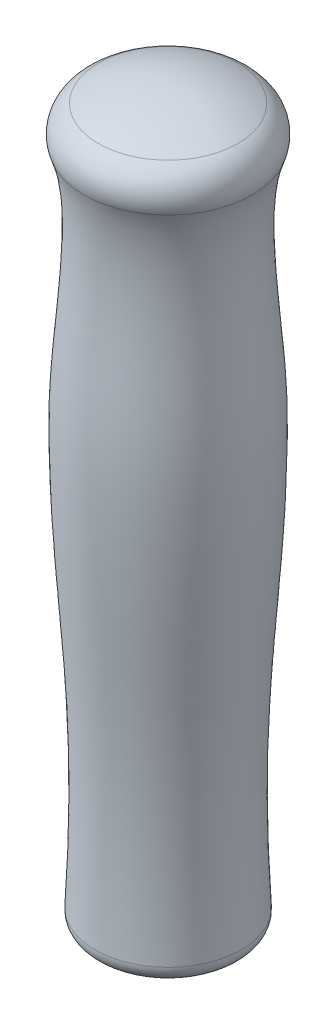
ISO-10303-21;
HEADER;
FILE_DESCRIPTION(('STEP AP214'),'2;1');
FILE_NAME('part.step','',(''),(''),'','','');
FILE_SCHEMA(('AUTOMOTIVE_DESIGN { 1 0 10303 214 1 1 1 1 }'));
ENDSEC;
DATA;
#1=APPLICATION_CONTEXT('core data for automotive mechanical design processes');
#2=APPLICATION_PROTOCOL_DEFINITION('international standard','automotive_design',2000,#1);
#3=PRODUCT_CONTEXT('',#1,'mechanical');
#4=PRODUCT('Part','Part','',(#3));
#5=PRODUCT_RELATED_PRODUCT_CATEGORY('part','',(#4));
#6=PRODUCT_DEFINITION_FORMATION('','',#4);
#7=PRODUCT_DEFINITION_CONTEXT('part definition',#1,'design');
#8=PRODUCT_DEFINITION('design','',#6,#7);
#9=PRODUCT_DEFINITION_SHAPE('','',#8);
#10=(LENGTH_UNIT() NAMED_UNIT(*) SI_UNIT(.MILLI.,.METRE.));
#11=(NAMED_UNIT(*) PLANE_ANGLE_UNIT() SI_UNIT($,.RADIAN.));
#12=(NAMED_UNIT(*) SI_UNIT($,.STERADIAN.) SOLID_ANGLE_UNIT());
#13=UNCERTAINTY_MEASURE_WITH_UNIT(LENGTH_MEASURE(1.E-05),#10,'distance_accuracy_value','');
#14=(GEOMETRIC_REPRESENTATION_CONTEXT(3) GLOBAL_UNCERTAINTY_ASSIGNED_CONTEXT((#13)) GLOBAL_UNIT_ASSIGNED_CONTEXT((#10,
#11,#12)) REPRESENTATION_CONTEXT('',''));
#15=CARTESIAN_POINT('',(0.,0.,0.));
#16=DIRECTION('',(0.,0.,1.));
#17=DIRECTION('',(1.,0.,0.));
#18=AXIS2_PLACEMENT_3D('',#15,#16,#17);
#19=CARTESIAN_POINT('',(0.,0.,0.));
#20=DIRECTION('',(0.,-1.,0.));
#21=DIRECTION('',(0.,0.,-1.));
#22=AXIS2_PLACEMENT_3D('',#19,#20,#21);
#23=CYLINDRICAL_SURFACE('',#22,7.9375);
#24=CARTESIAN_POINT('',(0.,0.,0.));
#25=DIRECTION('',(0.,-1.,0.));
#26=DIRECTION('',(0.,0.,-1.));
#27=AXIS2_PLACEMENT_3D('',#24,#25,#26);
#28=CIRCLE('',#27,7.9375);
#29=CARTESIAN_POINT('',(0.,0.,-7.9375));
#30=VERTEX_POINT('',#29);
#31=EDGE_CURVE('E61',#30,#30,#28,.T.);
#32=ORIENTED_EDGE('',*,*,#31,.T.);
#33=EDGE_LOOP('',(#32));
#34=FACE_BOUND('',#33,.T.);
#35=CARTESIAN_POINT('',(0.,111.70517642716,0.));
#36=DIRECTION('',(0.,-1.,0.));
#37=DIRECTION('',(0.,0.,-1.));
#38=AXIS2_PLACEMENT_3D('',#35,#36,#37);
#39=CIRCLE('',#38,7.9375);
#40=CARTESIAN_POINT('',(0.,111.70517642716,-7.9375));
#41=VERTEX_POINT('',#40);
#42=EDGE_CURVE('E65',#41,#41,#39,.T.);
#43=ORIENTED_EDGE('',*,*,#42,.F.);
#44=EDGE_LOOP('',(#43));
#45=FACE_BOUND('',#44,.T.);
#46=ADVANCED_FACE('F39',(#34,#45),#23,.F.);
#47=CARTESIAN_POINT('',(7.9375,0.,0.));
#48=DIRECTION('',(0.,-1.,0.));
#49=DIRECTION('',(0.,0.,-1.));
#50=AXIS2_PLACEMENT_3D('',#47,#48,#49);
#51=PLANE('',#50);
#52=CARTESIAN_POINT('',(0.,0.,0.));
#53=DIRECTION('',(0.,-1.,0.));
#54=DIRECTION('',(0.,0.,-1.));
#55=AXIS2_PLACEMENT_3D('',#52,#53,#54);
#56=CIRCLE('',#55,9.05646088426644);
#57=CARTESIAN_POINT('',(0.,0.,-9.05646088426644));
#58=VERTEX_POINT('',#57);
#59=EDGE_CURVE('E55',#58,#58,#56,.T.);
#60=ORIENTED_EDGE('',*,*,#59,.T.);
#61=EDGE_LOOP('',(#60));
#62=FACE_BOUND('',#61,.T.);
#63=ORIENTED_EDGE('',*,*,#31,.F.);
#64=EDGE_LOOP('',(#63));
#65=FACE_BOUND('',#64,.T.);
#66=ADVANCED_FACE('F80',(#62,#65),#51,.T.);
#67=CARTESIAN_POINT('',(11.7475,0.,0.));
#68=CARTESIAN_POINT('',(9.90178856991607,30.0572507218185,0.));
#69=CARTESIAN_POINT('',(13.1309924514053,43.6565437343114,0.));
#70=CARTESIAN_POINT('',(13.6026668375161,83.0189240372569,0.));
#71=CARTESIAN_POINT('',(9.45895023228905,103.277798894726,0.));
#72=CARTESIAN_POINT('',(15.1474127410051,110.596527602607,0.));
#73=B_SPLINE_CURVE_WITH_KNOTS('',3,(#67,#68,#69,#70,#71,#72),.UNSPECIFIED.,.F.,.F.,(4,1,1,4),
(0.,0.584486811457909,0.665001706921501,1.),.UNSPECIFIED.);
#74=CARTESIAN_POINT('',(0.,0.,0.));
#75=DIRECTION('',(0.,-1.,0.));
#76=AXIS1_PLACEMENT('',#74,#75);
#77=SURFACE_OF_REVOLUTION('',#73,#76);
#78=CARTESIAN_POINT('',(0.,107.31352181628,0.));
#79=DIRECTION('',(0.,-1.,0.));
#80=DIRECTION('',(0.,0.,-1.));
#81=AXIS2_PLACEMENT_3D('',#78,#79,#80);
#82=CIRCLE('',#81,13.3617665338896);
#83=CARTESIAN_POINT('',(0.,107.31352181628,-13.3617665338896));
#84=VERTEX_POINT('',#83);
#85=EDGE_CURVE('E46',#84,#84,#82,.T.);
#86=ORIENTED_EDGE('',*,*,#85,.T.);
#87=EDGE_LOOP('',(#86));
#88=FACE_BOUND('',#87,.T.);
#89=CARTESIAN_POINT('',(0.,2.67726435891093,0.));
#90=DIRECTION('',(0.,-1.,0.));
#91=DIRECTION('',(0.,0.,-1.));
#92=AXIS2_PLACEMENT_3D('',#89,#90,#91);
#93=CIRCLE('',#92,11.5927492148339);
#94=CARTESIAN_POINT('',(0.,2.67726435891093,-11.5927492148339));
#95=VERTEX_POINT('',#94);
#96=EDGE_CURVE('E50',#95,#95,#93,.F.);
#97=ORIENTED_EDGE('',*,*,#96,.T.);
#98=EDGE_LOOP('',(#97));
#99=FACE_BOUND('',#98,.T.);
#100=ADVANCED_FACE('F75',(#88,#99),#77,.F.);
#101=CARTESIAN_POINT('',(0.,91.5594103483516,0.));
#102=DIRECTION('',(0.,-1.,0.));
#103=DIRECTION('',(1.,0.,0.));
#104=AXIS2_PLACEMENT_3D('',#101,#102,#103);
#105=SPHERICAL_SURFACE('',#104,24.3280896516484);
#106=CARTESIAN_POINT('',(0.,113.223951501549,0.));
#107=DIRECTION('',(0.,-1.,0.));
#108=DIRECTION('',(0.,0.,-1.));
#109=AXIS2_PLACEMENT_3D('',#106,#107,#108);
#110=CIRCLE('',#109,11.0681345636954);
#111=CARTESIAN_POINT('',(0.,113.223951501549,-11.0681345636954));
#112=VERTEX_POINT('',#111);
#113=EDGE_CURVE('E10',#112,#112,#110,.F.);
#114=ORIENTED_EDGE('',*,*,#113,.T.);
#115=EDGE_LOOP('',(#114));
#116=FACE_BOUND('',#115,.T.);
#117=ADVANCED_FACE('F79',(#116),#105,.T.);
#118=CARTESIAN_POINT('',(0.,91.5594103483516,0.));
#119=DIRECTION('',(0.,-1.,0.));
#120=DIRECTION('',(1.,0.,0.));
#121=AXIS2_PLACEMENT_3D('',#118,#119,#120);
#122=SPHERICAL_SURFACE('',#121,21.6530782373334);
#123=ORIENTED_EDGE('',*,*,#42,.T.);
#124=EDGE_LOOP('',(#123));
#125=FACE_BOUND('',#124,.T.);
#126=ADVANCED_FACE('F89',(#125),#122,.F.);
#127=CARTESIAN_POINT('',(0.,2.54,0.));
#128=DIRECTION('',(0.,-1.,0.));
#129=DIRECTION('',(0.,0.,-1.));
#130=AXIS2_PLACEMENT_3D('',#127,#128,#129);
#131=TOROIDAL_SURFACE('',#130,9.05646088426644,2.54);
#132=ORIENTED_EDGE('',*,*,#96,.F.);
#133=EDGE_LOOP('',(#132));
#134=FACE_BOUND('',#133,.T.);
#135=ORIENTED_EDGE('',*,*,#59,.F.);
#136=EDGE_LOOP('',(#135));
#137=FACE_BOUND('',#136,.T.);
#138=ADVANCED_FACE('F87',(#134,#137),#131,.T.);
#139=CARTESIAN_POINT('',(0.,108.982871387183,0.));
#140=DIRECTION('',(0.,-1.,0.));
#141=DIRECTION('',(0.,0.,-1.));
#142=AXIS2_PLACEMENT_3D('',#139,#140,#141);
#143=TOROIDAL_SURFACE('',#142,8.9014214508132,4.7625);
#144=ORIENTED_EDGE('',*,*,#113,.F.);
#145=EDGE_LOOP('',(#144));
#146=FACE_BOUND('',#145,.T.);
#147=ORIENTED_EDGE('',*,*,#85,.F.);
#148=EDGE_LOOP('',(#147));
#149=FACE_BOUND('',#148,.T.);
#150=ADVANCED_FACE('F41',(#146,#149),#143,.T.);
#151=CLOSED_SHELL('',(#46,#66,#100,#117,#126,#138,#150));
#152=MANIFOLD_SOLID_BREP('B2',#151);
#153=ADVANCED_BREP_SHAPE_REPRESENTATION('',(#18,#152),#14);
#154=SHAPE_DEFINITION_REPRESENTATION(#9,#153);
ENDSEC;
END-ISO-10303-21;
